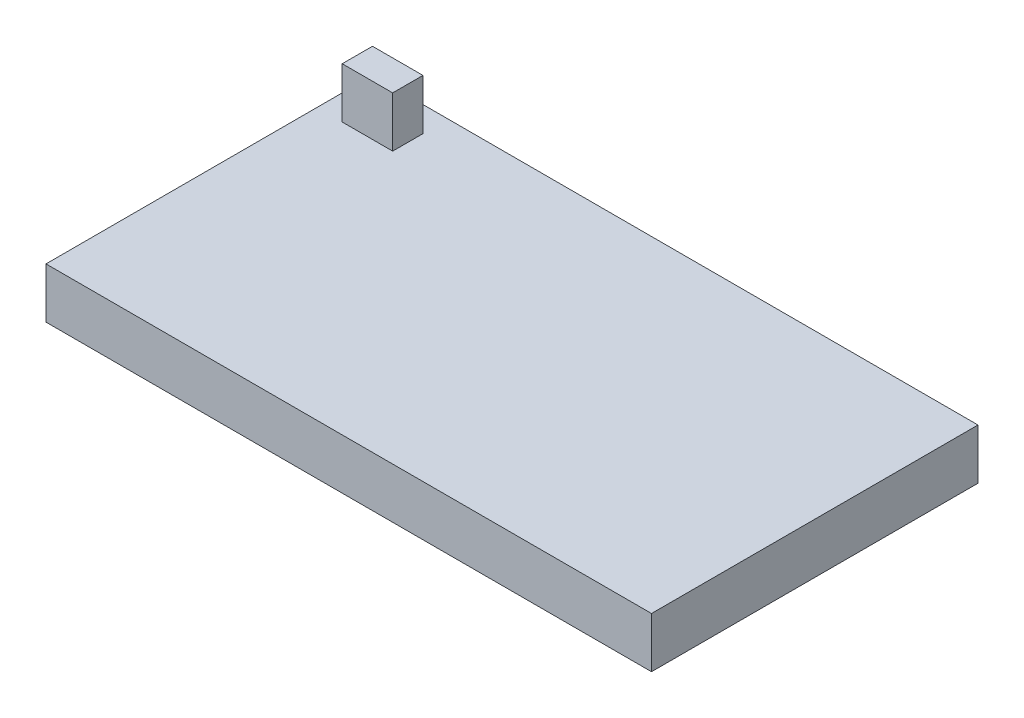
from build123d import *

# Parameters (mm, degrees)
SKETCH1_W      = 152.4
SKETCH1_H      = 82.172932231
EXTRUDE1_DEPTH = 12.7
SKETCH2_W      = 12.7
SKETCH2_H      = 7.62
EXTRUDE2_DEPTH = 12.7


with BuildPart() as part:
    # Sketch1 → Extrude1 (new body)
    with BuildSketch(Plane(origin=(0, 0, 0), x_dir=(1, 0, 0), z_dir=(0, 1, 0))):
        with Locations((0, -2.986466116)):
            Rectangle(SKETCH1_W, SKETCH1_H)
    extrude(amount=EXTRUDE1_DEPTH)

    # Sketch2 → Extrude2 (add)
    with BuildSketch(Plane(origin=(0, 12.7, 0), x_dir=(1, 0, 0), z_dir=(0, 1, 0))):
        with Locations((-63.5, 27.94)):
            Rectangle(SKETCH2_W, SKETCH2_H)
    extrude(amount=EXTRUDE2_DEPTH)


solid = part.part
